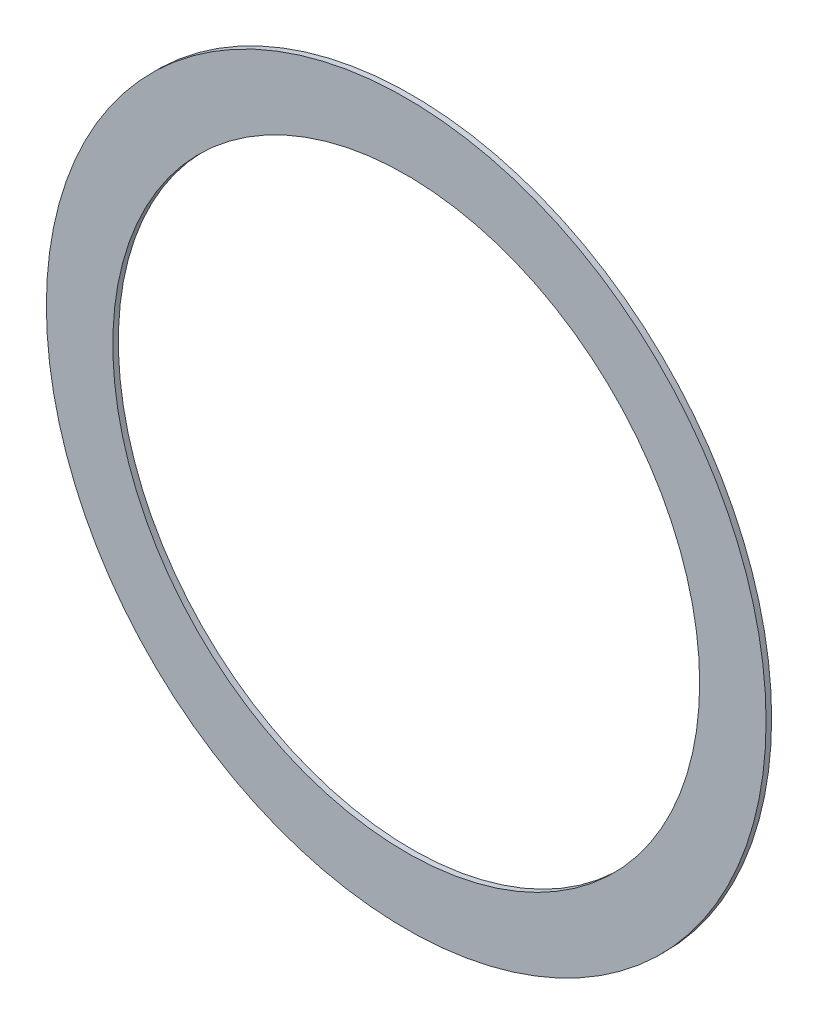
ISO-10303-21;
HEADER;
FILE_DESCRIPTION(('STEP AP214'),'2;1');
FILE_NAME('part.step','',(''),(''),'','','');
FILE_SCHEMA(('AUTOMOTIVE_DESIGN { 1 0 10303 214 1 1 1 1 }'));
ENDSEC;
DATA;
#1=APPLICATION_CONTEXT('core data for automotive mechanical design processes');
#2=APPLICATION_PROTOCOL_DEFINITION('international standard','automotive_design',2000,#1);
#3=PRODUCT_CONTEXT('',#1,'mechanical');
#4=PRODUCT('Part','Part','',(#3));
#5=PRODUCT_RELATED_PRODUCT_CATEGORY('part','',(#4));
#6=PRODUCT_DEFINITION_FORMATION('','',#4);
#7=PRODUCT_DEFINITION_CONTEXT('part definition',#1,'design');
#8=PRODUCT_DEFINITION('design','',#6,#7);
#9=PRODUCT_DEFINITION_SHAPE('','',#8);
#10=(LENGTH_UNIT() NAMED_UNIT(*) SI_UNIT(.MILLI.,.METRE.));
#11=(NAMED_UNIT(*) PLANE_ANGLE_UNIT() SI_UNIT($,.RADIAN.));
#12=(NAMED_UNIT(*) SI_UNIT($,.STERADIAN.) SOLID_ANGLE_UNIT());
#13=UNCERTAINTY_MEASURE_WITH_UNIT(LENGTH_MEASURE(1.E-05),#10,'distance_accuracy_value','');
#14=(GEOMETRIC_REPRESENTATION_CONTEXT(3) GLOBAL_UNCERTAINTY_ASSIGNED_CONTEXT((#13)) GLOBAL_UNIT_ASSIGNED_CONTEXT((#10,
#11,#12)) REPRESENTATION_CONTEXT('',''));
#15=CARTESIAN_POINT('',(0.,0.,0.));
#16=DIRECTION('',(0.,0.,1.));
#17=DIRECTION('',(1.,0.,0.));
#18=AXIS2_PLACEMENT_3D('',#15,#16,#17);
#19=CARTESIAN_POINT('',(0.,0.,3.175));
#20=DIRECTION('',(0.,0.,1.));
#21=DIRECTION('',(1.,0.,0.));
#22=AXIS2_PLACEMENT_3D('',#19,#20,#21);
#23=PLANE('',#22);
#24=CARTESIAN_POINT('',(0.,0.,3.175));
#25=DIRECTION('',(0.,0.,1.));
#26=DIRECTION('',(1.,0.,0.));
#27=AXIS2_PLACEMENT_3D('',#24,#25,#26);
#28=CIRCLE('',#27,206.375);
#29=CARTESIAN_POINT('',(206.375,0.,3.175));
#30=VERTEX_POINT('',#29);
#31=EDGE_CURVE('E10',#30,#30,#28,.T.);
#32=ORIENTED_EDGE('',*,*,#31,.T.);
#33=EDGE_LOOP('',(#32));
#34=FACE_BOUND('',#33,.T.);
#35=CARTESIAN_POINT('',(0.,0.,3.175));
#36=DIRECTION('',(0.,0.,1.));
#37=DIRECTION('',(1.,0.,0.));
#38=AXIS2_PLACEMENT_3D('',#35,#36,#37);
#39=CIRCLE('',#38,168.275);
#40=CARTESIAN_POINT('',(168.275,0.,3.175));
#41=VERTEX_POINT('',#40);
#42=EDGE_CURVE('E41',#41,#41,#39,.T.);
#43=ORIENTED_EDGE('',*,*,#42,.F.);
#44=EDGE_LOOP('',(#43));
#45=FACE_BOUND('',#44,.T.);
#46=ADVANCED_FACE('F30',(#34,#45),#23,.T.);
#47=CARTESIAN_POINT('',(0.,0.,0.));
#48=DIRECTION('',(0.,0.,1.));
#49=DIRECTION('',(1.,0.,0.));
#50=AXIS2_PLACEMENT_3D('',#47,#48,#49);
#51=PLANE('',#50);
#52=CARTESIAN_POINT('',(0.,0.,0.));
#53=DIRECTION('',(0.,0.,1.));
#54=DIRECTION('',(1.,0.,0.));
#55=AXIS2_PLACEMENT_3D('',#52,#53,#54);
#56=CIRCLE('',#55,206.375);
#57=CARTESIAN_POINT('',(206.375,0.,0.));
#58=VERTEX_POINT('',#57);
#59=EDGE_CURVE('E34',#58,#58,#56,.T.);
#60=ORIENTED_EDGE('',*,*,#59,.F.);
#61=EDGE_LOOP('',(#60));
#62=FACE_BOUND('',#61,.T.);
#63=CARTESIAN_POINT('',(0.,0.,0.));
#64=DIRECTION('',(0.,0.,1.));
#65=DIRECTION('',(1.,0.,0.));
#66=AXIS2_PLACEMENT_3D('',#63,#64,#65);
#67=CIRCLE('',#66,168.275);
#68=CARTESIAN_POINT('',(168.275,0.,0.));
#69=VERTEX_POINT('',#68);
#70=EDGE_CURVE('E43',#69,#69,#67,.T.);
#71=ORIENTED_EDGE('',*,*,#70,.T.);
#72=EDGE_LOOP('',(#71));
#73=FACE_BOUND('',#72,.T.);
#74=ADVANCED_FACE('F53',(#62,#73),#51,.F.);
#75=CARTESIAN_POINT('',(0.,0.,3.175));
#76=DIRECTION('',(0.,0.,-1.));
#77=DIRECTION('',(-1.,0.,0.));
#78=AXIS2_PLACEMENT_3D('',#75,#76,#77);
#79=CYLINDRICAL_SURFACE('',#78,206.375);
#80=ORIENTED_EDGE('',*,*,#31,.F.);
#81=EDGE_LOOP('',(#80));
#82=FACE_BOUND('',#81,.T.);
#83=ORIENTED_EDGE('',*,*,#59,.T.);
#84=EDGE_LOOP('',(#83));
#85=FACE_BOUND('',#84,.T.);
#86=ADVANCED_FACE('F32',(#82,#85),#79,.T.);
#87=CARTESIAN_POINT('',(0.,0.,3.175));
#88=DIRECTION('',(0.,0.,-1.));
#89=DIRECTION('',(-1.,0.,0.));
#90=AXIS2_PLACEMENT_3D('',#87,#88,#89);
#91=CYLINDRICAL_SURFACE('',#90,168.275);
#92=ORIENTED_EDGE('',*,*,#42,.T.);
#93=EDGE_LOOP('',(#92));
#94=FACE_BOUND('',#93,.T.);
#95=ORIENTED_EDGE('',*,*,#70,.F.);
#96=EDGE_LOOP('',(#95));
#97=FACE_BOUND('',#96,.T.);
#98=ADVANCED_FACE('F49',(#94,#97),#91,.F.);
#99=CLOSED_SHELL('',(#46,#74,#86,#98));
#100=MANIFOLD_SOLID_BREP('B2',#99);
#101=ADVANCED_BREP_SHAPE_REPRESENTATION('',(#18,#100),#14);
#102=SHAPE_DEFINITION_REPRESENTATION(#9,#101);
ENDSEC;
END-ISO-10303-21;
